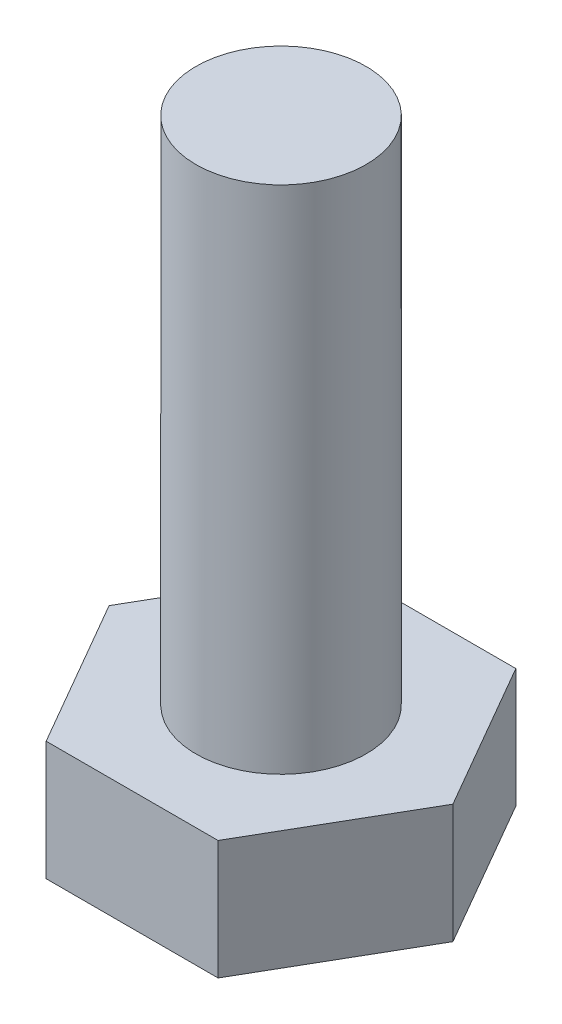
ISO-10303-21;
HEADER;
FILE_DESCRIPTION(('STEP AP214'),'2;1');
FILE_NAME('part.step','',(''),(''),'','','');
FILE_SCHEMA(('AUTOMOTIVE_DESIGN { 1 0 10303 214 1 1 1 1 }'));
ENDSEC;
DATA;
#1=APPLICATION_CONTEXT('core data for automotive mechanical design processes');
#2=APPLICATION_PROTOCOL_DEFINITION('international standard','automotive_design',2000,#1);
#3=PRODUCT_CONTEXT('',#1,'mechanical');
#4=PRODUCT('Part','Part','',(#3));
#5=PRODUCT_RELATED_PRODUCT_CATEGORY('part','',(#4));
#6=PRODUCT_DEFINITION_FORMATION('','',#4);
#7=PRODUCT_DEFINITION_CONTEXT('part definition',#1,'design');
#8=PRODUCT_DEFINITION('design','',#6,#7);
#9=PRODUCT_DEFINITION_SHAPE('','',#8);
#10=(LENGTH_UNIT() NAMED_UNIT(*) SI_UNIT(.MILLI.,.METRE.));
#11=(NAMED_UNIT(*) PLANE_ANGLE_UNIT() SI_UNIT($,.RADIAN.));
#12=(NAMED_UNIT(*) SI_UNIT($,.STERADIAN.) SOLID_ANGLE_UNIT());
#13=UNCERTAINTY_MEASURE_WITH_UNIT(LENGTH_MEASURE(1.E-05),#10,'distance_accuracy_value','');
#14=(GEOMETRIC_REPRESENTATION_CONTEXT(3) GLOBAL_UNCERTAINTY_ASSIGNED_CONTEXT((#13)) GLOBAL_UNIT_ASSIGNED_CONTEXT((#10,
#11,#12)) REPRESENTATION_CONTEXT('',''));
#15=CARTESIAN_POINT('',(0.,0.,0.));
#16=DIRECTION('',(0.,0.,1.));
#17=DIRECTION('',(1.,0.,0.));
#18=AXIS2_PLACEMENT_3D('',#15,#16,#17);
#19=CARTESIAN_POINT('',(-13.9378221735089,6.1,3.49999999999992));
#20=DIRECTION('',(0.,1.,0.));
#21=DIRECTION('',(-0.499999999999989,0.,0.866025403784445));
#22=AXIS2_PLACEMENT_3D('',#19,#20,#21);
#23=PLANE('',#22);
#24=DIRECTION('',(-1.,0.,0.));
#25=VECTOR('',#24,1.);
#26=CARTESIAN_POINT('',(-17.9792740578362,6.1,3.5));
#27=LINE('',#26,#25);
#28=CARTESIAN_POINT('',(-17.9792740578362,6.1,3.5));
#29=VERTEX_POINT('',#28);
#30=CARTESIAN_POINT('',(-22.0207259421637,6.1,3.5));
#31=VERTEX_POINT('',#30);
#32=EDGE_CURVE('E103',#29,#31,#27,.T.);
#33=ORIENTED_EDGE('',*,*,#32,.F.);
#34=DIRECTION('',(-0.499999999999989,0.,0.866025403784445));
#35=VECTOR('',#34,1.);
#36=CARTESIAN_POINT('',(-15.9585481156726,6.1,0.));
#37=LINE('',#36,#35);
#38=CARTESIAN_POINT('',(-15.9585481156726,6.1,0.));
#39=VERTEX_POINT('',#38);
#40=EDGE_CURVE('E64',#39,#29,#37,.T.);
#41=ORIENTED_EDGE('',*,*,#40,.F.);
#42=DIRECTION('',(0.500000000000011,0.,0.866025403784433));
#43=VECTOR('',#42,1.);
#44=CARTESIAN_POINT('',(-17.9792740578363,6.1,-3.5));
#45=LINE('',#44,#43);
#46=CARTESIAN_POINT('',(-17.9792740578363,6.1,-3.5));
#47=VERTEX_POINT('',#46);
#48=EDGE_CURVE('E58',#47,#39,#45,.T.);
#49=ORIENTED_EDGE('',*,*,#48,.F.);
#50=DIRECTION('',(1.,0.,0.));
#51=VECTOR('',#50,1.);
#52=CARTESIAN_POINT('',(-22.0207259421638,6.1,-3.5));
#53=LINE('',#52,#51);
#54=CARTESIAN_POINT('',(-22.0207259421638,6.1,-3.5));
#55=VERTEX_POINT('',#54);
#56=EDGE_CURVE('E93',#55,#47,#53,.T.);
#57=ORIENTED_EDGE('',*,*,#56,.F.);
#58=DIRECTION('',(0.499999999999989,0.,-0.866025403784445));
#59=VECTOR('',#58,1.);
#60=CARTESIAN_POINT('',(-24.0414518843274,6.1,0.));
#61=LINE('',#60,#59);
#62=CARTESIAN_POINT('',(-24.0414518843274,6.1,0.));
#63=VERTEX_POINT('',#62);
#64=EDGE_CURVE('E109',#63,#55,#61,.T.);
#65=ORIENTED_EDGE('',*,*,#64,.F.);
#66=DIRECTION('',(-0.500000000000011,0.,-0.866025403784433));
#67=VECTOR('',#66,1.);
#68=CARTESIAN_POINT('',(-22.0207259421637,6.1,3.5));
#69=LINE('',#68,#67);
#70=EDGE_CURVE('E106',#31,#63,#69,.T.);
#71=ORIENTED_EDGE('',*,*,#70,.F.);
#72=EDGE_LOOP('',(#33,#41,#49,#57,#65,#71));
#73=FACE_BOUND('',#72,.T.);
#74=CARTESIAN_POINT('',(-20.,6.1,0.));
#75=DIRECTION('',(0.,-1.,0.));
#76=DIRECTION('',(0.499999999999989,0.,-0.866025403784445));
#77=AXIS2_PLACEMENT_3D('',#74,#75,#76);
#78=CIRCLE('',#77,2.);
#79=CARTESIAN_POINT('',(-19.,6.1,-1.73205080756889));
#80=VERTEX_POINT('',#79);
#81=EDGE_CURVE('E107',#80,#80,#78,.T.);
#82=ORIENTED_EDGE('',*,*,#81,.T.);
#83=EDGE_LOOP('',(#82));
#84=FACE_BOUND('',#83,.T.);
#85=ADVANCED_FACE('F17',(#73,#84),#23,.T.);
#86=CARTESIAN_POINT('',(-17.9792740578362,3.3,3.5));
#87=DIRECTION('',(0.,0.,-1.));
#88=DIRECTION('',(1.,0.,0.));
#89=AXIS2_PLACEMENT_3D('',#86,#87,#88);
#90=PLANE('',#89);
#91=ORIENTED_EDGE('',*,*,#32,.T.);
#92=DIRECTION('',(0.,1.,0.));
#93=VECTOR('',#92,1.);
#94=CARTESIAN_POINT('',(-22.0207259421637,3.3,3.5));
#95=LINE('',#94,#93);
#96=CARTESIAN_POINT('',(-22.0207259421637,3.3,3.5));
#97=VERTEX_POINT('',#96);
#98=EDGE_CURVE('E11',#97,#31,#95,.T.);
#99=ORIENTED_EDGE('',*,*,#98,.F.);
#100=DIRECTION('',(-1.,0.,0.));
#101=VECTOR('',#100,1.);
#102=CARTESIAN_POINT('',(-17.9792740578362,3.3,3.5));
#103=LINE('',#102,#101);
#104=CARTESIAN_POINT('',(-17.9792740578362,3.3,3.5));
#105=VERTEX_POINT('',#104);
#106=EDGE_CURVE('E115',#105,#97,#103,.T.);
#107=ORIENTED_EDGE('',*,*,#106,.F.);
#108=DIRECTION('',(0.,1.,0.));
#109=VECTOR('',#108,1.);
#110=CARTESIAN_POINT('',(-17.9792740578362,3.3,3.5));
#111=LINE('',#110,#109);
#112=EDGE_CURVE('E99',#105,#29,#111,.T.);
#113=ORIENTED_EDGE('',*,*,#112,.T.);
#114=EDGE_LOOP('',(#91,#99,#107,#113));
#115=FACE_BOUND('',#114,.T.);
#116=ADVANCED_FACE('F19',(#115),#90,.F.);
#117=CARTESIAN_POINT('',(-22.0207259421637,3.3,3.5));
#118=DIRECTION('',(0.866025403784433,0.,-0.500000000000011));
#119=DIRECTION('',(0.500000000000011,0.,0.866025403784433));
#120=AXIS2_PLACEMENT_3D('',#117,#118,#119);
#121=PLANE('',#120);
#122=ORIENTED_EDGE('',*,*,#70,.T.);
#123=DIRECTION('',(0.,1.,0.));
#124=VECTOR('',#123,1.);
#125=CARTESIAN_POINT('',(-24.0414518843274,3.3,0.));
#126=LINE('',#125,#124);
#127=CARTESIAN_POINT('',(-24.0414518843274,3.3,0.));
#128=VERTEX_POINT('',#127);
#129=EDGE_CURVE('E27',#128,#63,#126,.T.);
#130=ORIENTED_EDGE('',*,*,#129,.F.);
#131=DIRECTION('',(-0.500000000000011,0.,-0.866025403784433));
#132=VECTOR('',#131,1.);
#133=CARTESIAN_POINT('',(-22.0207259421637,3.3,3.5));
#134=LINE('',#133,#132);
#135=EDGE_CURVE('E72',#97,#128,#134,.T.);
#136=ORIENTED_EDGE('',*,*,#135,.F.);
#137=ORIENTED_EDGE('',*,*,#98,.T.);
#138=EDGE_LOOP('',(#122,#130,#136,#137));
#139=FACE_BOUND('',#138,.T.);
#140=ADVANCED_FACE('F147',(#139),#121,.F.);
#141=CARTESIAN_POINT('',(-24.0414518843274,3.3,0.));
#142=DIRECTION('',(0.866025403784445,0.,0.499999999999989));
#143=DIRECTION('',(-0.499999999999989,0.,0.866025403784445));
#144=AXIS2_PLACEMENT_3D('',#141,#142,#143);
#145=PLANE('',#144);
#146=ORIENTED_EDGE('',*,*,#64,.T.);
#147=DIRECTION('',(0.,1.,0.));
#148=VECTOR('',#147,1.);
#149=CARTESIAN_POINT('',(-22.0207259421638,3.3,-3.5));
#150=LINE('',#149,#148);
#151=CARTESIAN_POINT('',(-22.0207259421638,3.3,-3.5));
#152=VERTEX_POINT('',#151);
#153=EDGE_CURVE('E94',#152,#55,#150,.T.);
#154=ORIENTED_EDGE('',*,*,#153,.F.);
#155=DIRECTION('',(0.499999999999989,0.,-0.866025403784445));
#156=VECTOR('',#155,1.);
#157=CARTESIAN_POINT('',(-24.0414518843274,3.3,0.));
#158=LINE('',#157,#156);
#159=EDGE_CURVE('E85',#128,#152,#158,.T.);
#160=ORIENTED_EDGE('',*,*,#159,.F.);
#161=ORIENTED_EDGE('',*,*,#129,.T.);
#162=EDGE_LOOP('',(#146,#154,#160,#161));
#163=FACE_BOUND('',#162,.T.);
#164=ADVANCED_FACE('F122',(#163),#145,.F.);
#165=CARTESIAN_POINT('',(-22.0207259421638,3.3,-3.5));
#166=DIRECTION('',(0.,0.,1.));
#167=DIRECTION('',(-1.,0.,0.));
#168=AXIS2_PLACEMENT_3D('',#165,#166,#167);
#169=PLANE('',#168);
#170=ORIENTED_EDGE('',*,*,#56,.T.);
#171=DIRECTION('',(0.,1.,0.));
#172=VECTOR('',#171,1.);
#173=CARTESIAN_POINT('',(-17.9792740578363,3.3,-3.5));
#174=LINE('',#173,#172);
#175=CARTESIAN_POINT('',(-17.9792740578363,3.3,-3.5));
#176=VERTEX_POINT('',#175);
#177=EDGE_CURVE('E90',#176,#47,#174,.T.);
#178=ORIENTED_EDGE('',*,*,#177,.F.);
#179=DIRECTION('',(1.,0.,0.));
#180=VECTOR('',#179,1.);
#181=CARTESIAN_POINT('',(-22.0207259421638,3.3,-3.5));
#182=LINE('',#181,#180);
#183=EDGE_CURVE('E79',#152,#176,#182,.T.);
#184=ORIENTED_EDGE('',*,*,#183,.F.);
#185=ORIENTED_EDGE('',*,*,#153,.T.);
#186=EDGE_LOOP('',(#170,#178,#184,#185));
#187=FACE_BOUND('',#186,.T.);
#188=ADVANCED_FACE('F91',(#187),#169,.F.);
#189=CARTESIAN_POINT('',(-17.9792740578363,3.3,-3.5));
#190=DIRECTION('',(-0.866025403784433,0.,0.500000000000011));
#191=DIRECTION('',(-0.500000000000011,0.,-0.866025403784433));
#192=AXIS2_PLACEMENT_3D('',#189,#190,#191);
#193=PLANE('',#192);
#194=ORIENTED_EDGE('',*,*,#48,.T.);
#195=DIRECTION('',(0.,1.,0.));
#196=VECTOR('',#195,1.);
#197=CARTESIAN_POINT('',(-15.9585481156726,3.3,0.));
#198=LINE('',#197,#196);
#199=CARTESIAN_POINT('',(-15.9585481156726,3.3,0.));
#200=VERTEX_POINT('',#199);
#201=EDGE_CURVE('E95',#200,#39,#198,.T.);
#202=ORIENTED_EDGE('',*,*,#201,.F.);
#203=DIRECTION('',(0.500000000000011,0.,0.866025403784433));
#204=VECTOR('',#203,1.);
#205=CARTESIAN_POINT('',(-17.9792740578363,3.3,-3.5));
#206=LINE('',#205,#204);
#207=EDGE_CURVE('E83',#176,#200,#206,.T.);
#208=ORIENTED_EDGE('',*,*,#207,.F.);
#209=ORIENTED_EDGE('',*,*,#177,.T.);
#210=EDGE_LOOP('',(#194,#202,#208,#209));
#211=FACE_BOUND('',#210,.T.);
#212=ADVANCED_FACE('F97',(#211),#193,.F.);
#213=CARTESIAN_POINT('',(-15.9585481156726,3.3,0.));
#214=DIRECTION('',(-0.866025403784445,0.,-0.499999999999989));
#215=DIRECTION('',(0.499999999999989,0.,-0.866025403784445));
#216=AXIS2_PLACEMENT_3D('',#213,#214,#215);
#217=PLANE('',#216);
#218=ORIENTED_EDGE('',*,*,#40,.T.);
#219=ORIENTED_EDGE('',*,*,#112,.F.);
#220=DIRECTION('',(-0.499999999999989,0.,0.866025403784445));
#221=VECTOR('',#220,1.);
#222=CARTESIAN_POINT('',(-15.9585481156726,3.3,0.));
#223=LINE('',#222,#221);
#224=EDGE_CURVE('E35',#200,#105,#223,.T.);
#225=ORIENTED_EDGE('',*,*,#224,.F.);
#226=ORIENTED_EDGE('',*,*,#201,.T.);
#227=EDGE_LOOP('',(#218,#219,#225,#226));
#228=FACE_BOUND('',#227,.T.);
#229=ADVANCED_FACE('F129',(#228),#217,.F.);
#230=CARTESIAN_POINT('',(-13.9378221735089,3.3,3.49999999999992));
#231=DIRECTION('',(0.,1.,0.));
#232=DIRECTION('',(-0.499999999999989,0.,0.866025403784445));
#233=AXIS2_PLACEMENT_3D('',#230,#231,#232);
#234=PLANE('',#233);
#235=ORIENTED_EDGE('',*,*,#106,.T.);
#236=ORIENTED_EDGE('',*,*,#135,.T.);
#237=ORIENTED_EDGE('',*,*,#159,.T.);
#238=ORIENTED_EDGE('',*,*,#183,.T.);
#239=ORIENTED_EDGE('',*,*,#207,.T.);
#240=ORIENTED_EDGE('',*,*,#224,.T.);
#241=EDGE_LOOP('',(#235,#236,#237,#238,#239,#240));
#242=FACE_BOUND('',#241,.T.);
#243=ADVANCED_FACE('F81',(#242),#234,.F.);
#244=CARTESIAN_POINT('',(-20.,6.1,0.));
#245=DIRECTION('',(0.,-1.,0.));
#246=DIRECTION('',(0.499999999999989,0.,-0.866025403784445));
#247=AXIS2_PLACEMENT_3D('',#244,#245,#246);
#248=CYLINDRICAL_SURFACE('',#247,2.);
#249=ORIENTED_EDGE('',*,*,#81,.F.);
#250=EDGE_LOOP('',(#249));
#251=FACE_BOUND('',#250,.T.);
#252=CARTESIAN_POINT('',(-20.,18.1,0.));
#253=DIRECTION('',(0.,1.,0.));
#254=DIRECTION('',(0.,0.,1.));
#255=AXIS2_PLACEMENT_3D('',#252,#253,#254);
#256=CIRCLE('',#255,2.);
#257=CARTESIAN_POINT('',(-20.,18.1,2.));
#258=VERTEX_POINT('',#257);
#259=EDGE_CURVE('E160',#258,#258,#256,.T.);
#260=ORIENTED_EDGE('',*,*,#259,.F.);
#261=EDGE_LOOP('',(#260));
#262=FACE_BOUND('',#261,.T.);
#263=ADVANCED_FACE('F138',(#251,#262),#248,.T.);
#264=CARTESIAN_POINT('',(-18.2679491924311,18.1,0.999999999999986));
#265=DIRECTION('',(0.,-1.,0.));
#266=DIRECTION('',(0.499999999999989,0.,-0.866025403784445));
#267=AXIS2_PLACEMENT_3D('',#264,#265,#266);
#268=PLANE('',#267);
#269=ORIENTED_EDGE('',*,*,#259,.T.);
#270=EDGE_LOOP('',(#269));
#271=FACE_BOUND('',#270,.T.);
#272=ADVANCED_FACE('F151',(#271),#268,.F.);
#273=CLOSED_SHELL('',(#85,#116,#140,#164,#188,#212,#229,#243,#263,#272));
#274=MANIFOLD_SOLID_BREP('B1',#273);
#275=ADVANCED_BREP_SHAPE_REPRESENTATION('',(#18,#274),#14);
#276=SHAPE_DEFINITION_REPRESENTATION(#9,#275);
ENDSEC;
END-ISO-10303-21;
